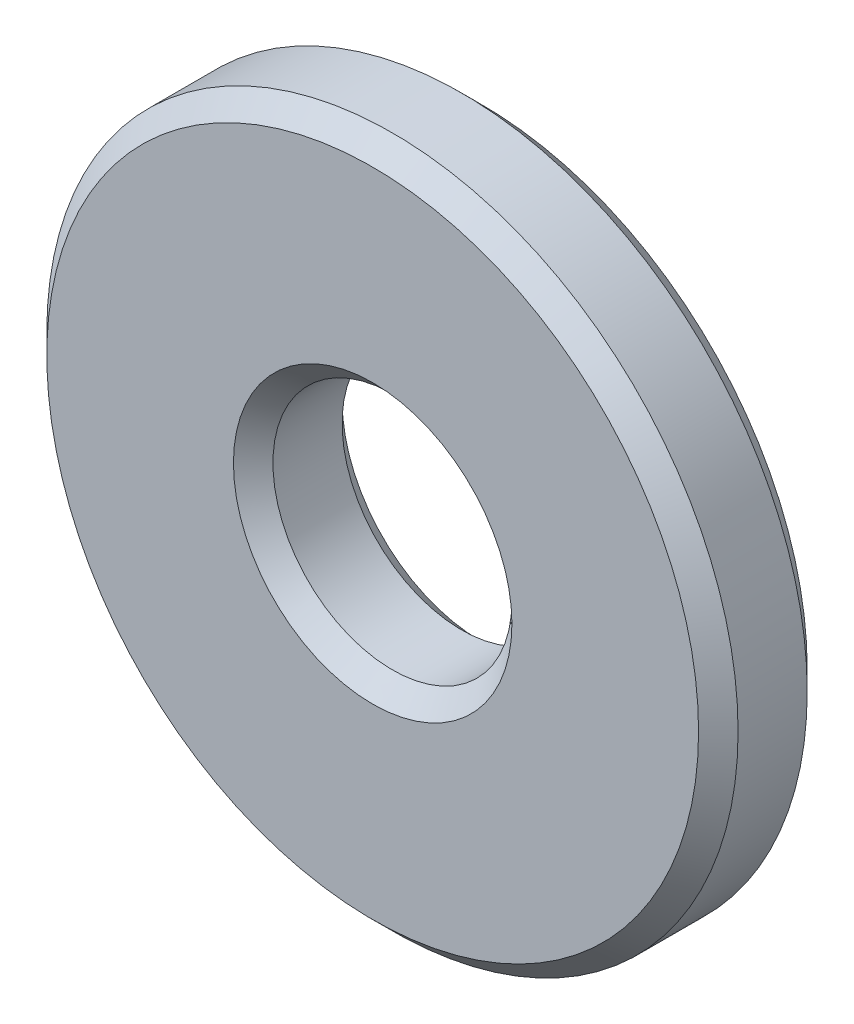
from build123d import *

# Parameters (mm, degrees)
ESQUISSE1_R          = 17.5
ESQUISSE1_R_2        = 6.05
BASE_EXTRUSION_DEPTH = 5.5
CHANFREIN1_SIZE      = 1


with BuildPart() as part:
    # Esquisse1 → Base-Extrusion (new body)
    with BuildSketch(Plane.XY):
        Circle(ESQUISSE1_R)
        Circle(ESQUISSE1_R_2, mode=Mode.SUBTRACT)
    extrude(amount=BASE_EXTRUSION_DEPTH)

    # Chanfrein1
    chanfrein1_edges = [part.edges().sort_by_distance(p)[0] for p in [
        (-17.5, 0, 0),
        (-17.5, 0, 5.5),
        (-6.05, 0, 0),
        (-6.05, 0, 5.5),
    ]]
    chamfer(chanfrein1_edges, length=CHANFREIN1_SIZE)


solid = part.part
